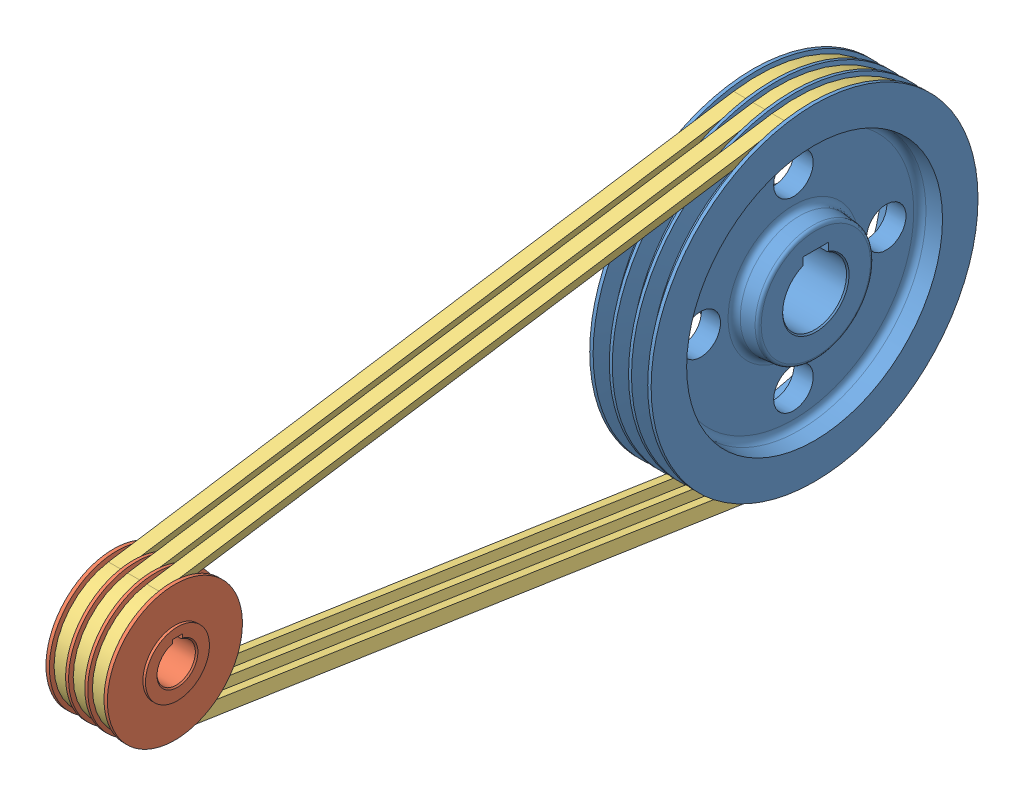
SolidWorks assembly 实心轮_孔板轮.SLDASM, configuration 默认 (file format 3400). Lengths in mm.
Overall size (51 255.5 680.5).
5 component instances, 3 part files, 6 mates.
Components (placement in the parent):
- 大带轮_孔板轮-1: 大带轮_孔板轮.SLDPRT [A] at (-27.3809 -27.5884 0) size (50 255.5 255.5)
- 小带轮_实心轮-1: 小带轮_实心轮.SLDPRT [默认] at (-27.3809 -27.5884 500) size (50 105.5 105.5)
- sk_皮带-1: sk_皮带.SLDPRT [默认] at (-18.3809 -27.5884 0) x (-1 0 0) z (0 0 -1) size (11 250 675)
- sk_皮带-2: sk_皮带.SLDPRT [默认] at (-3.3809 -27.5884 0) x (-1 0 0) z (0 0 -1) size (11 250 675)
- sk_皮带-3: sk_皮带.SLDPRT [默认] at (11.6191 -27.5884 0) x (-1 0 0) z (0 0 -1) size (11 250 675)
Mates (geometry in assembly coordinates):
- 重合1: coincident aligned: plane of 小带轮_实心轮-1 through (-27.3809 -12.5884 500) normal (-1 0 0)
- 重合2: coincident aligned: unknown of 小带轮_实心轮-1
- 距离1: distance = 500 mm aligned: unknown of 小带轮_实心轮-1
- 同心1: concentric anti-aligned: cylinder of sk_皮带-1
- 重合4: coincident: cone of sk_皮带-1
- 相切1: tangent anti-aligned: unknown of 小带轮_实心轮-1; unknown of sk_皮带-1
